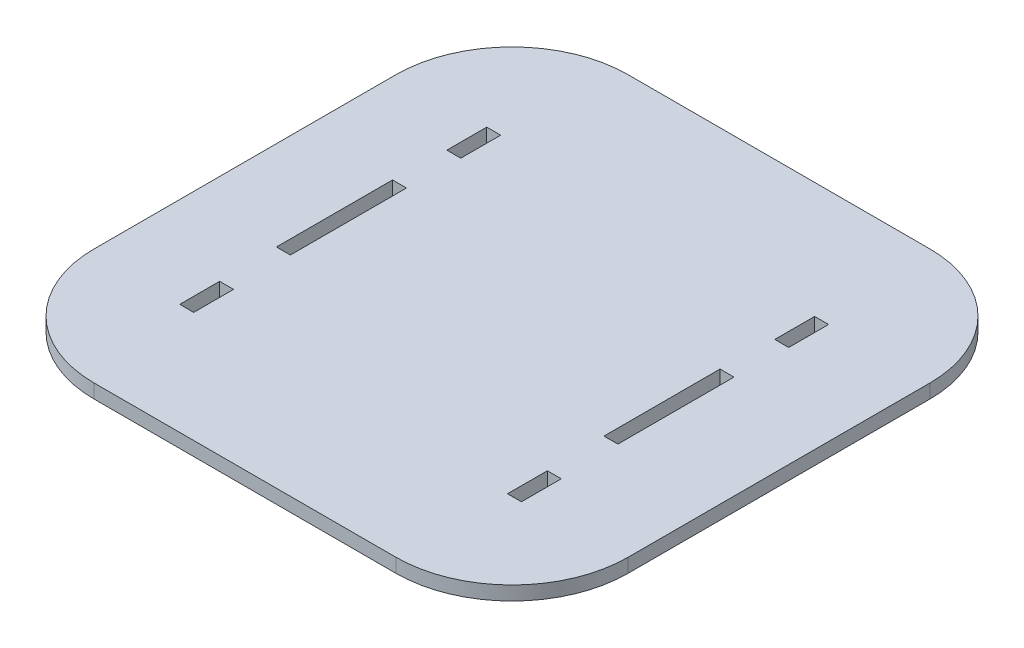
from build123d import *

# Parameters (mm, degrees)
BOSS_EXTRUDE2_DEPTH = 12
SKETCH2_W           = 12
SKETCH2_H           = 34.343402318
CUT_EXTRUDE1_DEPTH  = 12
SKETCH3_W           = 12
SKETCH3_H           = 100
CUT_EXTRUDE3_DEPTH  = 12


with BuildPart() as part:
    # Sketch1 → Boss-Extrude2 (new body)
    with BuildSketch(Plane(origin=(0, 0, 0), x_dir=(1, 0, 0), z_dir=(0, 1, 0))):
        with BuildLine():
            Line((-38.729194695, 315.446866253), (-38.729194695, 55.446866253))
            ThreePointArc((-38.729194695, 55.446866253), (-9.439872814, -15.263811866), (61.270805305, -44.553133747))
            Line((61.270805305, -44.553133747), (321.270805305, -44.553133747))
            ThreePointArc((321.270805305, -44.553133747), (391.981483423, -15.263811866), (421.270805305, 55.446866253))
            Line((421.270805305, 55.446866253), (421.270805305, 315.446866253))
            ThreePointArc((421.270805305, 315.446866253), (391.981483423, 386.157544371), (321.270805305, 415.446866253))
            Line((321.270805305, 415.446866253), (61.270805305, 415.446866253))
            ThreePointArc((61.270805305, 415.446866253), (-9.439872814, 386.157544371), (-38.729194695, 315.446866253))
        make_face()
    extrude(amount=BOSS_EXTRUDE2_DEPTH)

    # Sketch2 → Cut-Extrude1 (cut)
    with BuildSketch(Plane(origin=(0, 12, 0), x_dir=(1, 0, 0), z_dir=(0, 1, 0))):
        with Locations((327.972768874, 298.275165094)):
            Rectangle(SKETCH2_W, SKETCH2_H)
        with Locations((45.507136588, 298.275165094)):
            Rectangle(SKETCH2_W, SKETCH2_H)
        Polygon((51.507136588, 51.020605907), (51.507136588, 85.363994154), (39.507136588, 85.370429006), (39.507136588, 51.020605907), align=None)
        Polygon((333.972768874, 50.875572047), (333.972768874, 85.212525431), (321.972768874, 85.218960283), (321.972768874, 50.875572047), align=None)
    extrude(amount=-CUT_EXTRUDE1_DEPTH, mode=Mode.SUBTRACT)

    # Sketch3 → Cut-Extrude3 (cut)
    with BuildSketch(Plane(origin=(0, 12, 0), x_dir=(1, 0, 0), z_dir=(0, 1, 0))):
        with Locations((44.34942031, 185.446866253)):
            Rectangle(SKETCH3_W, SKETCH3_H)
        with Locations((326.487286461, 185.446866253)):
            Rectangle(SKETCH3_W, SKETCH3_H)
    extrude(amount=-CUT_EXTRUDE3_DEPTH, mode=Mode.SUBTRACT)


solid = part.part
